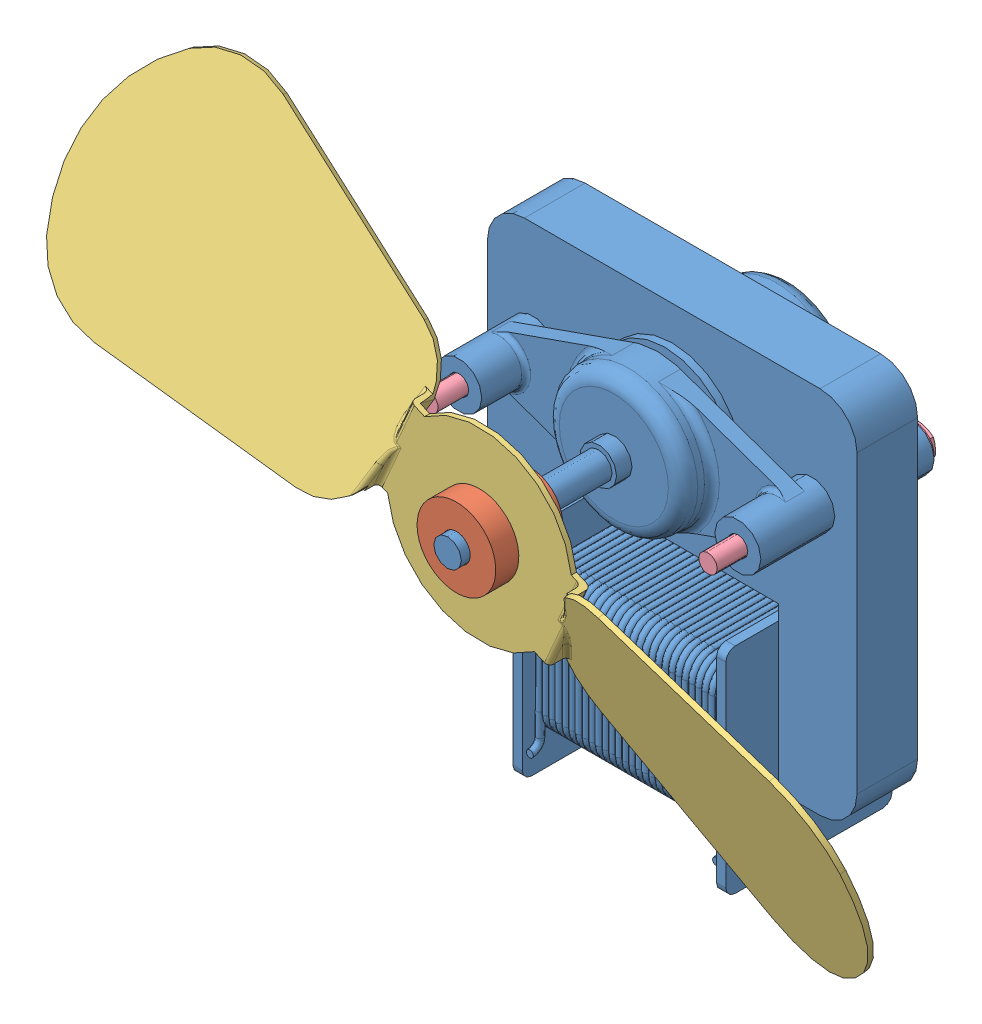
SolidWorks assembly Fan.SLDASM, configuration Default (file format 3100). Lengths in mm.
Overall size (149.91 104.96 61.92).
5 component instances, 4 part files, 11 mates.
Components (placement in the parent):
- Motor-1: Motor.sldprt [Default] x (-1 0 0) z (0 0 -1) size (63.5 74.93 59.05)
- Bushing-1: Bushing.sldprt [Default] at (0 13.97 42.291) x (0.617489 -0.786579 0) z (-0.786579 -0.617489 0) size (13.53 12.7 13.53)
- Blade-1: Blade.sldprt [Default] at (-14.2339 20.1714 37.8841) x (-0.916769 0.399417 0) z (-0.399417 -0.916769 0) size (145.74 17.59 40.81)
- Bolt-mtr-1: Bolt-mtr.sldprt [Default] at (-23.9776 13.97 -11.8745) x (0.986218 0.165449 0) z (-0.165449 0.986218 0) size (6.6 36.7 6.6)
- Bolt-mtr-2: Bolt-mtr.sldprt [Default] at (23.9776 13.97 -11.8745) x (0.391636 0.92012 0) z (-0.92012 0.391636 0) size (6.6 36.7 6.6)
Mates (geometry in assembly coordinates):
- Coincident1: coincident anti-aligned: plane of Motor-1; plane of assembly
- Coincident2: coincident aligned: plane of Motor-1; plane of assembly
- Coincident3: coincident anti-aligned: plane of Motor-1; plane of assembly
- Concentric1: concentric anti-aligned: cylinder of Motor-1; cylinder of Bushing-1
- Distance1: distance = 1.524 mm aligned: plane of Motor-1; plane of Bushing-1
- Concentric2: concentric aligned: cylinder of Bushing-1; cylinder of Blade-1
- Coincident4: coincident anti-aligned: plane of Bushing-1; plane of Blade-1
- Concentric4: concentric anti-aligned: cylinder of Motor-1; cylinder of Bolt-mtr-1
- Coincident6: coincident anti-aligned: plane of Motor-1; plane of Bolt-mtr-1
- Concentric5: concentric anti-aligned: cylinder of Motor-1; cylinder of Bolt-mtr-2
- Coincident7: coincident anti-aligned: plane of Motor-1; plane of Bolt-mtr-2
